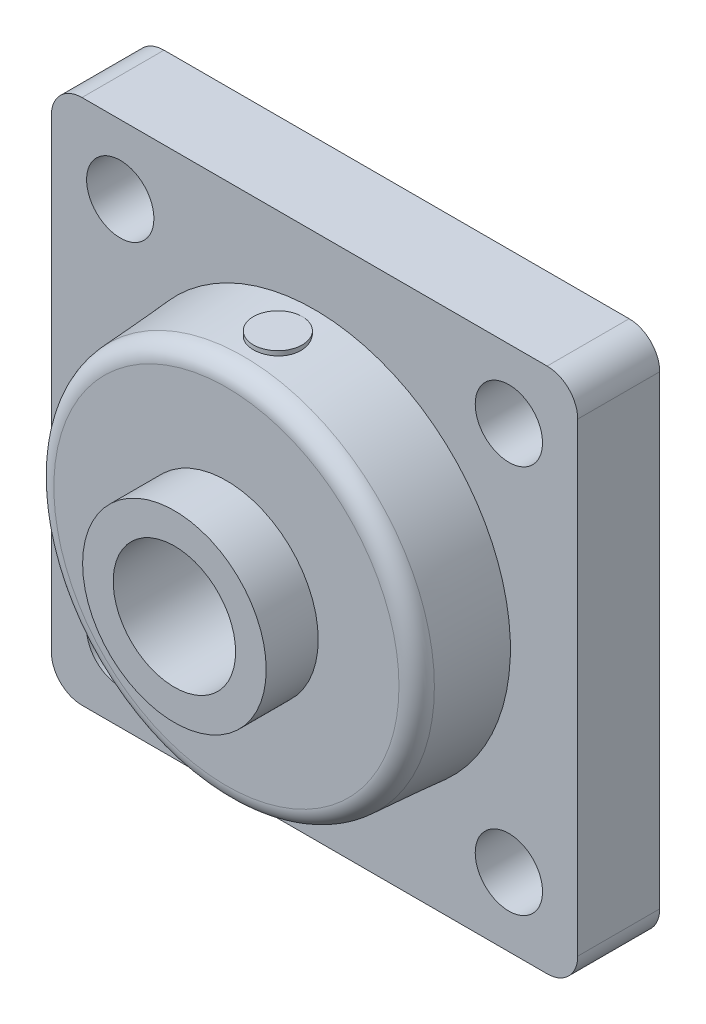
from build123d import *

# Parameters (mm, degrees)
ESQUISSE1_R             = 5.5
EXTRUSION1_DEPTH        = 13.4
ESQUISSE2_R             = 32
EXTRUSION2_DEPTH        = 14.4
EXTRUSION2_TAPER        = 4
CONG_1_R                = 3
ESQUISSE3_R             = 15
EXTRUSION3_DEPTH        = 8.5
ESQUISSE6_R             = 4
EXTRUSION4_DEPTH        = 32
ESQUISSE4_R             = 10
ENL_V_MAT_EXTRU_1_DEPTH = 71.821536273


with BuildPart() as part:
    # Esquisse1 → Extrusion1 (new body)
    with BuildSketch(Plane.XY):
        with BuildLine():
            Line((-38, -43), (38, -43))
            ThreePointArc((38, -43), (41.535533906, -41.535533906), (43, -38))
            Line((43, -38), (43, 38))
            ThreePointArc((43, 38), (41.535533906, 41.535533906), (38, 43))
            Line((38, 43), (-38, 43))
            ThreePointArc((-38, 43), (-41.535533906, 41.535533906), (-43, 38))
            Line((-43, 38), (-43, -38))
            ThreePointArc((-43, -38), (-41.535533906, -41.535533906), (-38, -43))
        make_face()
        with Locations((-31.75, 31.75)):
            Circle(ESQUISSE1_R, mode=Mode.SUBTRACT)
        with Locations(Location((31.75, 31.75, 0), (0, 0, 180))):
            Circle(ESQUISSE1_R, mode=Mode.SUBTRACT)
        with Locations((-31.75, -31.75)):
            Circle(ESQUISSE1_R, mode=Mode.SUBTRACT)
        with Locations(Location((31.75, -31.75, 0), (0, 0, 180))):
            Circle(ESQUISSE1_R, mode=Mode.SUBTRACT)
    extrude(amount=EXTRUSION1_DEPTH)

    # Esquisse2 → Extrusion2 (add)
    with BuildSketch(Plane.XY.offset(13.4)):
        Circle(ESQUISSE2_R)
    extrude(amount=EXTRUSION2_DEPTH, taper=EXTRUSION2_TAPER)

    # Cong_1
    cong_1_edges = [part.edges().sort_by_distance(p)[0] for p in [
        (-30.993053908, 0, 27.8),
    ]]
    fillet(cong_1_edges, radius=CONG_1_R)

    # Esquisse3 → Extrusion3 (add)
    with BuildSketch(Plane.XY.offset(27.8)):
        Circle(ESQUISSE3_R)
    extrude(amount=EXTRUSION3_DEPTH)

    # Esquisse6 → Extrusion4 (add)
    with BuildSketch(Plane.ZX):
        with Locations(Location((19.4, 0, 0), (0, 0, 214.661531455))):
            Circle(ESQUISSE6_R)
    extrude(amount=EXTRUSION4_DEPTH)

    # Esquisse4 → Enl_v. mat.-Extru.1 (cut, through all)
    with BuildSketch(Plane.XY.offset(36.3)):
        Circle(ESQUISSE4_R)
    extrude(amount=-ENL_V_MAT_EXTRU_1_DEPTH, mode=Mode.SUBTRACT)


solid = part.part
